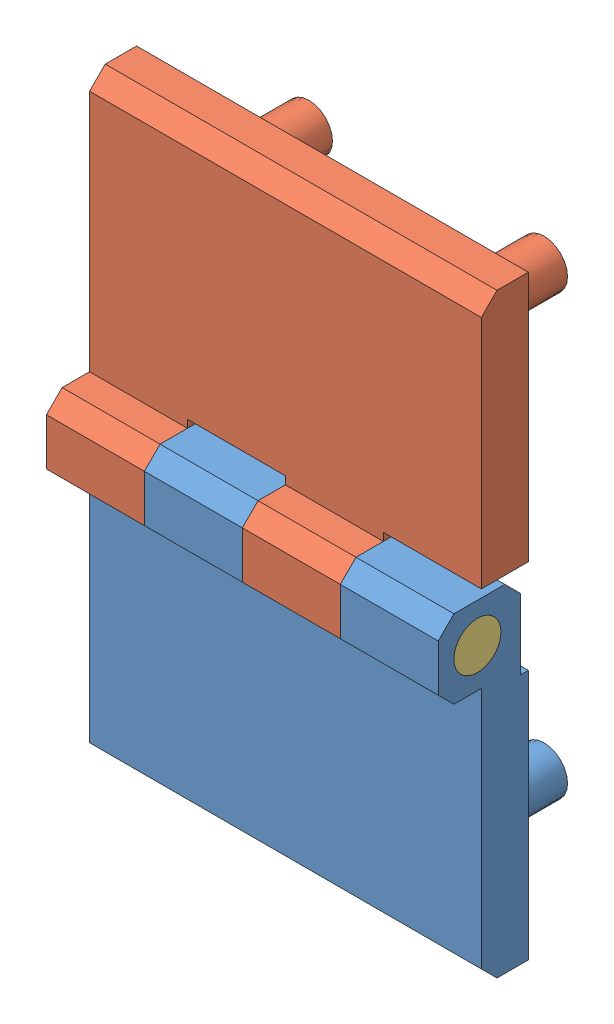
SolidWorks assembly FTH7650T.sldasm, configuration Default (file format 15000). Lengths in mm.
Overall size (50 76 23.5).
3 component instances, 3 part files, 0 mates.
Components (placement in the parent):
- FTH7650T_01-1: FTH7650T_01.SLDPRT [Default] at origin size (50 43 23.5)
- FTH7650T_02-1: FTH7650T_02.SLDPRT [Default] at (30 56 0) x (-1 0 0) z (0 0 1) size (50 43 23.5)
- FTH7650T_03-1: FTH7650T_03.SLDPRT [Default] at (-10 28 6.5) x (0 0 -1) z (1 0 0) size (6 6 50)
